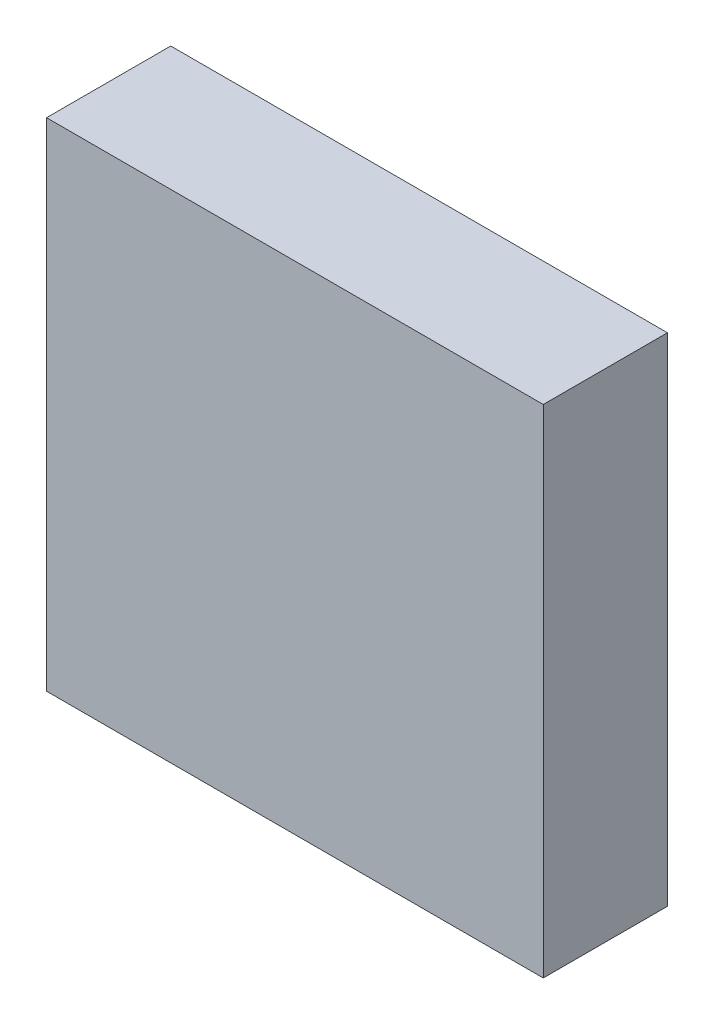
from build123d import *

# Parameters (mm, degrees)
ESQUISSE1_W        = 800
ESQUISSE1_H        = 800
BOSS_EXTRU_1_DEPTH = 200


with BuildPart() as part:
    # Esquisse1 → Boss.-Extru.1 (new body)
    with BuildSketch(Plane.XY):
        with Locations((183.520166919, 182.885057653)):
            Rectangle(ESQUISSE1_W, ESQUISSE1_H)
    extrude(amount=BOSS_EXTRU_1_DEPTH)


solid = part.part
